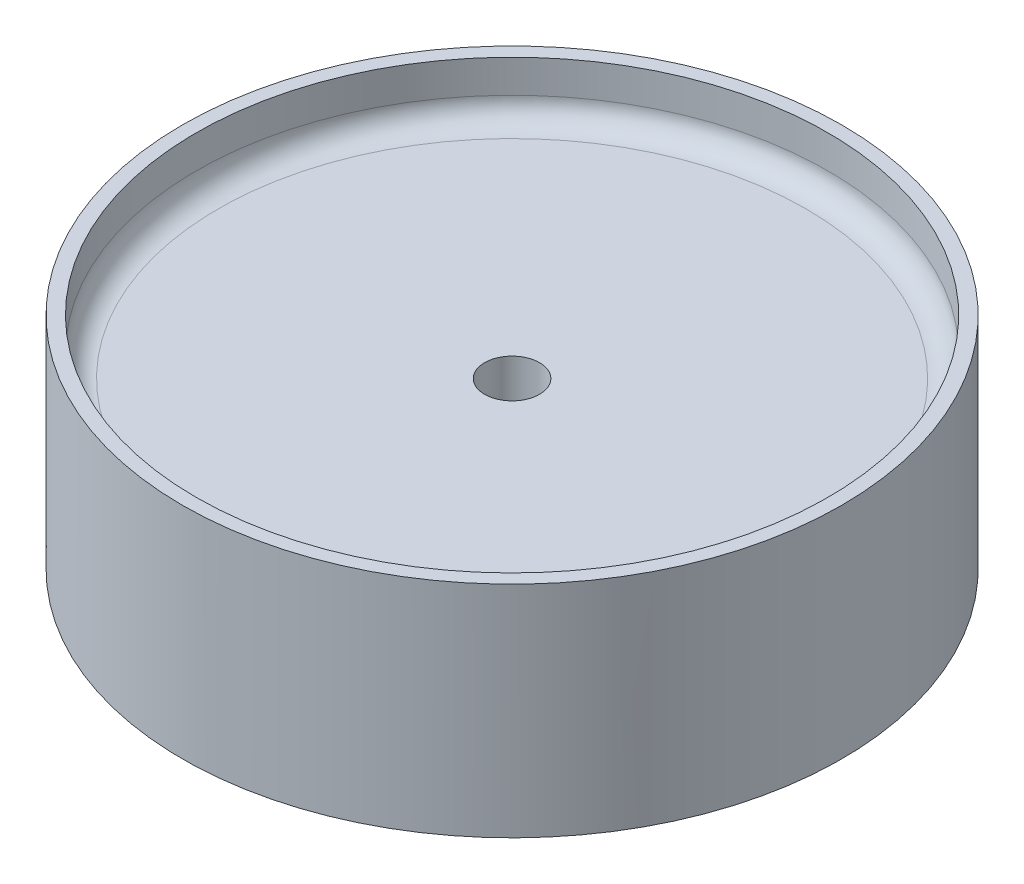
from build123d import *

# Parameters (mm, degrees)
SKETCH1_R           = 38.1
SKETCH1_R_2         = 3.175
BOSS_EXTRUDE1_DEPTH = 12.7
SKETCH2_R           = 38.1
SKETCH2_R_2         = 36.5125
BOSS_EXTRUDE2_DEPTH = 6.35
BOSS_EXTRUDE3_START = 6.35
SKETCH3_R           = 38.1
SKETCH3_R_2         = 36.5125
BOSS_EXTRUDE3_DEPTH = 6.35
FILLET1_R           = 2.54


with BuildPart() as part:
    # Sketch1 → Boss-Extrude1 (new body)
    with BuildSketch(Plane(origin=(0, 0, 0), x_dir=(1, 0, 0), z_dir=(0, 1, 0))):
        with Locations(Location((0, 0, 0), (0, 0, 270))):
            Circle(SKETCH1_R)
        with Locations(Location((0, 0, 0), (0, 0, 270))):
            Circle(SKETCH1_R_2, mode=Mode.SUBTRACT)
    extrude(amount=BOSS_EXTRUDE1_DEPTH)

    # Sketch2 → Boss-Extrude2 (add)
    with BuildSketch(Plane(origin=(0, 12.7, 0), x_dir=(1, 0, 0), z_dir=(0, 1, 0))):
        with Locations(Location((0, 0, 0), (0, 0, 270))):
            Circle(SKETCH2_R)
        with Locations(Location((0, 0, 0), (0, 0, 270))):
            Circle(SKETCH2_R_2, mode=Mode.SUBTRACT)
    extrude(amount=BOSS_EXTRUDE2_DEPTH)

    # Sketch3 → Boss-Extrude3 (add)
    with BuildSketch(Plane.XZ.offset(BOSS_EXTRUDE3_START)):
        with Locations(Location((0, 0, 0), (0, 0, 270))):
            Circle(SKETCH3_R)
        with Locations(Location((0, 0, 0), (0, 0, 90))):
            Circle(SKETCH3_R_2, mode=Mode.SUBTRACT)
    extrude(amount=-BOSS_EXTRUDE3_DEPTH)

    # Fillet1
    fillet1_edges = [part.edges().sort_by_distance(p)[0] for p in [
        (0, 0, -36.5125),
        (0, 12.7, -36.5125),
    ]]
    fillet(fillet1_edges, radius=FILLET1_R)


solid = part.part
